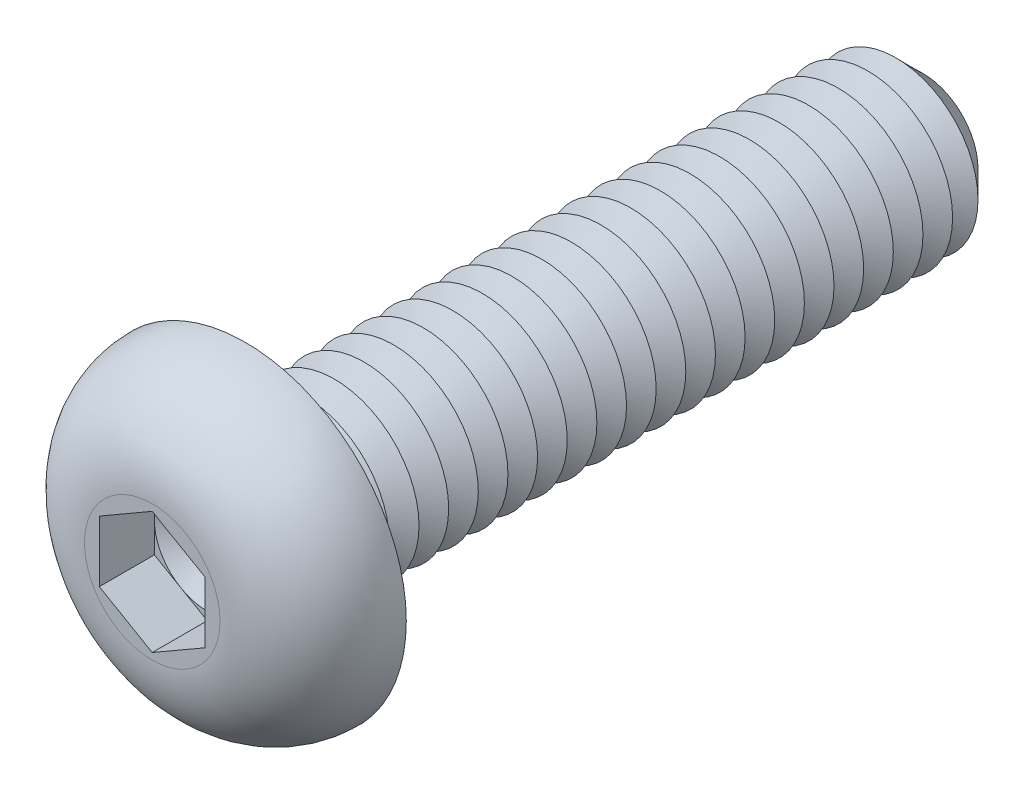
ISO-10303-21;
HEADER;
FILE_DESCRIPTION(('STEP AP214'),'2;1');
FILE_NAME('part.step','',(''),(''),'','','');
FILE_SCHEMA(('AUTOMOTIVE_DESIGN { 1 0 10303 214 1 1 1 1 }'));
ENDSEC;
DATA;
#1=APPLICATION_CONTEXT('core data for automotive mechanical design processes');
#2=APPLICATION_PROTOCOL_DEFINITION('international standard','automotive_design',2000,#1);
#3=PRODUCT_CONTEXT('',#1,'mechanical');
#4=PRODUCT('Part','Part','',(#3));
#5=PRODUCT_RELATED_PRODUCT_CATEGORY('part','',(#4));
#6=PRODUCT_DEFINITION_FORMATION('','',#4);
#7=PRODUCT_DEFINITION_CONTEXT('part definition',#1,'design');
#8=PRODUCT_DEFINITION('design','',#6,#7);
#9=PRODUCT_DEFINITION_SHAPE('','',#8);
#10=(LENGTH_UNIT() NAMED_UNIT(*) SI_UNIT(.MILLI.,.METRE.));
#11=(NAMED_UNIT(*) PLANE_ANGLE_UNIT() SI_UNIT($,.RADIAN.));
#12=(NAMED_UNIT(*) SI_UNIT($,.STERADIAN.) SOLID_ANGLE_UNIT());
#13=UNCERTAINTY_MEASURE_WITH_UNIT(LENGTH_MEASURE(1.E-05),#10,'distance_accuracy_value','');
#14=(GEOMETRIC_REPRESENTATION_CONTEXT(3) GLOBAL_UNCERTAINTY_ASSIGNED_CONTEXT((#13)) GLOBAL_UNIT_ASSIGNED_CONTEXT((#10,
#11,#12)) REPRESENTATION_CONTEXT('',''));
#15=CARTESIAN_POINT('',(0.,0.,0.));
#16=DIRECTION('',(0.,0.,1.));
#17=DIRECTION('',(1.,0.,0.));
#18=AXIS2_PLACEMENT_3D('',#15,#16,#17);
#19=CARTESIAN_POINT('',(0.,0.,0.900000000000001));
#20=DIRECTION('',(0.,0.,1.));
#21=DIRECTION('',(1.,0.,0.));
#22=AXIS2_PLACEMENT_3D('',#19,#20,#21);
#23=PLANE('',#22);
#24=CARTESIAN_POINT('',(0.,0.,0.900000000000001));
#25=DIRECTION('',(0.,0.,1.));
#26=DIRECTION('',(1.,0.,0.));
#27=AXIS2_PLACEMENT_3D('',#24,#25,#26);
#28=CIRCLE('',#27,1.25);
#29=CARTESIAN_POINT('',(1.25,0.,0.900000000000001));
#30=VERTEX_POINT('',#29);
#31=CARTESIAN_POINT('',(0.625,1.08253175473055,0.900000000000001));
#32=VERTEX_POINT('',#31);
#33=EDGE_CURVE('E117',#30,#32,#28,.T.);
#34=ORIENTED_EDGE('',*,*,#33,.F.);
#35=DIRECTION('',(0.,1.,0.));
#36=VECTOR('',#35,1.);
#37=CARTESIAN_POINT('',(1.25,-0.721687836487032,0.900000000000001));
#38=LINE('',#37,#36);
#39=CARTESIAN_POINT('',(1.25,0.721687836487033,0.900000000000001));
#40=VERTEX_POINT('',#39);
#41=EDGE_CURVE('E140',#30,#40,#38,.T.);
#42=ORIENTED_EDGE('',*,*,#41,.T.);
#43=DIRECTION('',(-0.866025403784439,0.5,0.));
#44=VECTOR('',#43,1.);
#45=CARTESIAN_POINT('',(1.25,0.721687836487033,0.900000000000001));
#46=LINE('',#45,#44);
#47=EDGE_CURVE('E135',#40,#32,#46,.T.);
#48=ORIENTED_EDGE('',*,*,#47,.T.);
#49=EDGE_LOOP('',(#34,#42,#48));
#50=FACE_BOUND('',#49,.T.);
#51=ADVANCED_FACE('F39',(#50),#23,.T.);
#52=CARTESIAN_POINT('',(0.,0.,0.900000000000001));
#53=DIRECTION('',(0.,0.,1.));
#54=DIRECTION('',(1.,0.,0.));
#55=AXIS2_PLACEMENT_3D('',#52,#53,#54);
#56=CIRCLE('',#55,1.25);
#57=CARTESIAN_POINT('',(-0.625,1.08253175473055,0.900000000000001));
#58=VERTEX_POINT('',#57);
#59=EDGE_CURVE('E11',#32,#58,#56,.T.);
#60=ORIENTED_EDGE('',*,*,#59,.F.);
#61=CARTESIAN_POINT('',(0.,1.44337567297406,0.900000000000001));
#62=VERTEX_POINT('',#61);
#63=EDGE_CURVE('E130',#32,#62,#46,.T.);
#64=ORIENTED_EDGE('',*,*,#63,.T.);
#65=DIRECTION('',(-0.866025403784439,-0.5,0.));
#66=VECTOR('',#65,1.);
#67=CARTESIAN_POINT('',(0.,1.44337567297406,0.900000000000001));
#68=LINE('',#67,#66);
#69=EDGE_CURVE('E132',#62,#58,#68,.T.);
#70=ORIENTED_EDGE('',*,*,#69,.T.);
#71=EDGE_LOOP('',(#60,#64,#70));
#72=FACE_BOUND('',#71,.T.);
#73=ADVANCED_FACE('F129',(#72),#23,.T.);
#74=CARTESIAN_POINT('',(-1.25,0.,0.900000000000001));
#75=VERTEX_POINT('',#74);
#76=EDGE_CURVE('E49',#58,#75,#56,.T.);
#77=ORIENTED_EDGE('',*,*,#76,.F.);
#78=CARTESIAN_POINT('',(-1.25,0.721687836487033,0.900000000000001));
#79=VERTEX_POINT('',#78);
#80=EDGE_CURVE('E143',#58,#79,#68,.T.);
#81=ORIENTED_EDGE('',*,*,#80,.T.);
#82=DIRECTION('',(0.,-1.,0.));
#83=VECTOR('',#82,1.);
#84=CARTESIAN_POINT('',(-1.25,0.721687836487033,0.900000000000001));
#85=LINE('',#84,#83);
#86=EDGE_CURVE('E153',#79,#75,#85,.T.);
#87=ORIENTED_EDGE('',*,*,#86,.T.);
#88=EDGE_LOOP('',(#77,#81,#87));
#89=FACE_BOUND('',#88,.T.);
#90=ADVANCED_FACE('F255',(#89),#23,.T.);
#91=CARTESIAN_POINT('',(-0.625,-1.08253175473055,0.900000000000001));
#92=VERTEX_POINT('',#91);
#93=EDGE_CURVE('E239',#75,#92,#56,.T.);
#94=ORIENTED_EDGE('',*,*,#93,.F.);
#95=CARTESIAN_POINT('',(-1.25,-0.721687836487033,0.900000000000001));
#96=VERTEX_POINT('',#95);
#97=EDGE_CURVE('E152',#75,#96,#85,.T.);
#98=ORIENTED_EDGE('',*,*,#97,.T.);
#99=DIRECTION('',(0.866025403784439,-0.5,0.));
#100=VECTOR('',#99,1.);
#101=CARTESIAN_POINT('',(-1.25,-0.721687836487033,0.900000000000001));
#102=LINE('',#101,#100);
#103=EDGE_CURVE('E158',#96,#92,#102,.T.);
#104=ORIENTED_EDGE('',*,*,#103,.T.);
#105=EDGE_LOOP('',(#94,#98,#104));
#106=FACE_BOUND('',#105,.T.);
#107=ADVANCED_FACE('F248',(#106),#23,.T.);
#108=CARTESIAN_POINT('',(0.625,-1.08253175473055,0.900000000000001));
#109=VERTEX_POINT('',#108);
#110=EDGE_CURVE('E56',#92,#109,#56,.T.);
#111=ORIENTED_EDGE('',*,*,#110,.F.);
#112=CARTESIAN_POINT('',(0.,-1.44337567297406,0.900000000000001));
#113=VERTEX_POINT('',#112);
#114=EDGE_CURVE('E157',#92,#113,#102,.T.);
#115=ORIENTED_EDGE('',*,*,#114,.T.);
#116=DIRECTION('',(0.866025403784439,0.5,0.));
#117=VECTOR('',#116,1.);
#118=CARTESIAN_POINT('',(0.,-1.44337567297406,0.900000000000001));
#119=LINE('',#118,#117);
#120=EDGE_CURVE('E163',#113,#109,#119,.T.);
#121=ORIENTED_EDGE('',*,*,#120,.T.);
#122=EDGE_LOOP('',(#111,#115,#121));
#123=FACE_BOUND('',#122,.T.);
#124=ADVANCED_FACE('F455',(#123),#23,.T.);
#125=CARTESIAN_POINT('',(0.,0.,-16.));
#126=DIRECTION('',(0.,0.,1.));
#127=DIRECTION('',(1.,0.,0.));
#128=AXIS2_PLACEMENT_3D('',#125,#126,#127);
#129=CYLINDRICAL_SURFACE('',#128,2.);
#130=CARTESIAN_POINT('',(0.,0.,-0.300000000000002));
#131=DIRECTION('',(0.,0.,1.));
#132=DIRECTION('',(1.,0.,0.));
#133=AXIS2_PLACEMENT_3D('',#130,#131,#132);
#134=CIRCLE('',#133,2.);
#135=CARTESIAN_POINT('',(2.,0.,-0.300000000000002));
#136=VERTEX_POINT('',#135);
#137=EDGE_CURVE('E221',#136,#136,#134,.F.);
#138=ORIENTED_EDGE('',*,*,#137,.T.);
#139=EDGE_LOOP('',(#138));
#140=FACE_BOUND('',#139,.T.);
#141=CARTESIAN_POINT('',(0.,0.,-0.699999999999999));
#142=DIRECTION('',(0.,0.,1.));
#143=DIRECTION('',(1.,0.,0.));
#144=AXIS2_PLACEMENT_3D('',#141,#142,#143);
#145=CIRCLE('',#144,2.);
#146=CARTESIAN_POINT('',(2.,0.,-0.699999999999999));
#147=VERTEX_POINT('',#146);
#148=EDGE_CURVE('E148',#147,#147,#145,.T.);
#149=ORIENTED_EDGE('',*,*,#148,.T.);
#150=EDGE_LOOP('',(#149));
#151=FACE_BOUND('',#150,.T.);
#152=ADVANCED_FACE('F439',(#140,#151),#129,.T.);
#153=CARTESIAN_POINT('',(0.,3.8,0.));
#154=DIRECTION('',(0.,0.,1.));
#155=DIRECTION('',(1.,0.,0.));
#156=AXIS2_PLACEMENT_3D('',#153,#154,#155);
#157=PLANE('',#156);
#158=CARTESIAN_POINT('',(0.,0.,0.));
#159=DIRECTION('',(0.,0.,1.));
#160=DIRECTION('',(1.,0.,0.));
#161=AXIS2_PLACEMENT_3D('',#158,#159,#160);
#162=CIRCLE('',#161,2.3);
#163=CARTESIAN_POINT('',(2.3,0.,0.));
#164=VERTEX_POINT('',#163);
#165=EDGE_CURVE('E230',#164,#164,#162,.T.);
#166=ORIENTED_EDGE('',*,*,#165,.T.);
#167=EDGE_LOOP('',(#166));
#168=FACE_BOUND('',#167,.T.);
#169=CARTESIAN_POINT('',(0.,0.,0.));
#170=DIRECTION('',(0.,0.,1.));
#171=DIRECTION('',(1.,0.,0.));
#172=AXIS2_PLACEMENT_3D('',#169,#170,#171);
#173=CIRCLE('',#172,3.8);
#174=CARTESIAN_POINT('',(3.8,0.,0.));
#175=VERTEX_POINT('',#174);
#176=EDGE_CURVE('E195',#175,#175,#173,.T.);
#177=ORIENTED_EDGE('',*,*,#176,.F.);
#178=EDGE_LOOP('',(#177));
#179=FACE_BOUND('',#178,.T.);
#180=ADVANCED_FACE('F485',(#168,#179),#157,.F.);
#181=CARTESIAN_POINT('',(0.,0.,2.2));
#182=DIRECTION('',(0.,0.,-1.));
#183=DIRECTION('',(-1.,0.,0.));
#184=AXIS2_PLACEMENT_3D('',#181,#182,#183);
#185=PLANE('',#184);
#186=DIRECTION('',(-0.866025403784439,-0.5,0.));
#187=VECTOR('',#186,1.);
#188=CARTESIAN_POINT('',(0.,1.44337567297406,2.2));
#189=LINE('',#188,#187);
#190=CARTESIAN_POINT('',(0.,1.44337567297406,2.2));
#191=VERTEX_POINT('',#190);
#192=CARTESIAN_POINT('',(-1.25,0.721687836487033,2.2));
#193=VERTEX_POINT('',#192);
#194=EDGE_CURVE('E173',#191,#193,#189,.T.);
#195=ORIENTED_EDGE('',*,*,#194,.F.);
#196=DIRECTION('',(-0.866025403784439,0.5,0.));
#197=VECTOR('',#196,1.);
#198=CARTESIAN_POINT('',(1.25,0.721687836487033,2.2));
#199=LINE('',#198,#197);
#200=CARTESIAN_POINT('',(1.25,0.721687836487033,2.2));
#201=VERTEX_POINT('',#200);
#202=EDGE_CURVE('E64',#201,#191,#199,.T.);
#203=ORIENTED_EDGE('',*,*,#202,.F.);
#204=DIRECTION('',(0.,1.,0.));
#205=VECTOR('',#204,1.);
#206=CARTESIAN_POINT('',(1.25,-0.721687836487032,2.2));
#207=LINE('',#206,#205);
#208=CARTESIAN_POINT('',(1.25,-0.721687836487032,2.2));
#209=VERTEX_POINT('',#208);
#210=EDGE_CURVE('E138',#209,#201,#207,.T.);
#211=ORIENTED_EDGE('',*,*,#210,.F.);
#212=DIRECTION('',(0.866025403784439,0.5,0.));
#213=VECTOR('',#212,1.);
#214=CARTESIAN_POINT('',(0.,-1.44337567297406,2.2));
#215=LINE('',#214,#213);
#216=CARTESIAN_POINT('',(0.,-1.44337567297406,2.2));
#217=VERTEX_POINT('',#216);
#218=EDGE_CURVE('E185',#217,#209,#215,.T.);
#219=ORIENTED_EDGE('',*,*,#218,.F.);
#220=DIRECTION('',(0.866025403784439,-0.5,0.));
#221=VECTOR('',#220,1.);
#222=CARTESIAN_POINT('',(-1.25,-0.721687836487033,2.2));
#223=LINE('',#222,#221);
#224=CARTESIAN_POINT('',(-1.25,-0.721687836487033,2.2));
#225=VERTEX_POINT('',#224);
#226=EDGE_CURVE('E181',#225,#217,#223,.T.);
#227=ORIENTED_EDGE('',*,*,#226,.F.);
#228=DIRECTION('',(0.,-1.,0.));
#229=VECTOR('',#228,1.);
#230=CARTESIAN_POINT('',(-1.25,0.721687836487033,2.2));
#231=LINE('',#230,#229);
#232=EDGE_CURVE('E177',#193,#225,#231,.T.);
#233=ORIENTED_EDGE('',*,*,#232,.F.);
#234=EDGE_LOOP('',(#195,#203,#211,#219,#227,#233));
#235=FACE_BOUND('',#234,.T.);
#236=CARTESIAN_POINT('',(0.,0.,2.2));
#237=DIRECTION('',(0.,0.,1.));
#238=DIRECTION('',(1.,0.,0.));
#239=AXIS2_PLACEMENT_3D('',#236,#237,#238);
#240=CIRCLE('',#239,1.6);
#241=CARTESIAN_POINT('',(1.6,0.,2.2));
#242=VERTEX_POINT('',#241);
#243=EDGE_CURVE('E213',#242,#242,#240,.T.);
#244=ORIENTED_EDGE('',*,*,#243,.T.);
#245=EDGE_LOOP('',(#244));
#246=FACE_BOUND('',#245,.T.);
#247=ADVANCED_FACE('F264',(#235,#246),#185,.F.);
#248=CARTESIAN_POINT('',(0.,0.,0.));
#249=DIRECTION('',(0.,0.,1.));
#250=DIRECTION('',(1.,0.,0.));
#251=AXIS2_PLACEMENT_3D('',#248,#249,#250);
#252=DEGENERATE_TOROIDAL_SURFACE('',#251,1.6,2.2,.T.);
#253=ORIENTED_EDGE('',*,*,#243,.F.);
#254=EDGE_LOOP('',(#253));
#255=FACE_BOUND('',#254,.T.);
#256=ORIENTED_EDGE('',*,*,#176,.T.);
#257=EDGE_LOOP('',(#256));
#258=FACE_BOUND('',#257,.T.);
#259=ADVANCED_FACE('F479',(#255,#258),#252,.T.);
#260=CARTESIAN_POINT('',(1.25,0.721687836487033,0.900000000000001));
#261=DIRECTION('',(0.5,0.866025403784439,0.));
#262=DIRECTION('',(-0.866025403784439,0.5,0.));
#263=AXIS2_PLACEMENT_3D('',#260,#261,#262);
#264=PLANE('',#263);
#265=ORIENTED_EDGE('',*,*,#202,.T.);
#266=DIRECTION('',(0.,0.,1.));
#267=VECTOR('',#266,1.);
#268=CARTESIAN_POINT('',(0.,1.44337567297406,0.900000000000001));
#269=LINE('',#268,#267);
#270=EDGE_CURVE('E136',#62,#191,#269,.T.);
#271=ORIENTED_EDGE('',*,*,#270,.F.);
#272=ORIENTED_EDGE('',*,*,#63,.F.);
#273=ORIENTED_EDGE('',*,*,#47,.F.);
#274=DIRECTION('',(0.,0.,1.));
#275=VECTOR('',#274,1.);
#276=CARTESIAN_POINT('',(1.25,0.721687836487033,0.900000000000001));
#277=LINE('',#276,#275);
#278=EDGE_CURVE('E192',#40,#201,#277,.T.);
#279=ORIENTED_EDGE('',*,*,#278,.T.);
#280=EDGE_LOOP('',(#265,#271,#272,#273,#279));
#281=FACE_BOUND('',#280,.T.);
#282=ADVANCED_FACE('F134',(#281),#264,.F.);
#283=CARTESIAN_POINT('',(1.25,-0.721687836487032,0.900000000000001));
#284=DIRECTION('',(1.,0.,0.));
#285=DIRECTION('',(0.,1.,0.));
#286=AXIS2_PLACEMENT_3D('',#283,#284,#285);
#287=PLANE('',#286);
#288=ORIENTED_EDGE('',*,*,#210,.T.);
#289=ORIENTED_EDGE('',*,*,#278,.F.);
#290=ORIENTED_EDGE('',*,*,#41,.F.);
#291=CARTESIAN_POINT('',(1.25,-0.721687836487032,0.900000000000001));
#292=VERTEX_POINT('',#291);
#293=EDGE_CURVE('E167',#292,#30,#38,.T.);
#294=ORIENTED_EDGE('',*,*,#293,.F.);
#295=DIRECTION('',(0.,0.,1.));
#296=VECTOR('',#295,1.);
#297=CARTESIAN_POINT('',(1.25,-0.721687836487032,0.900000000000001));
#298=LINE('',#297,#296);
#299=EDGE_CURVE('E196',#292,#209,#298,.T.);
#300=ORIENTED_EDGE('',*,*,#299,.T.);
#301=EDGE_LOOP('',(#288,#289,#290,#294,#300));
#302=FACE_BOUND('',#301,.T.);
#303=ADVANCED_FACE('F463',(#302),#287,.F.);
#304=CARTESIAN_POINT('',(0.,-1.44337567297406,0.900000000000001));
#305=DIRECTION('',(0.5,-0.866025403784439,0.));
#306=DIRECTION('',(0.866025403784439,0.5,0.));
#307=AXIS2_PLACEMENT_3D('',#304,#305,#306);
#308=PLANE('',#307);
#309=ORIENTED_EDGE('',*,*,#218,.T.);
#310=ORIENTED_EDGE('',*,*,#299,.F.);
#311=EDGE_CURVE('E162',#109,#292,#119,.T.);
#312=ORIENTED_EDGE('',*,*,#311,.F.);
#313=ORIENTED_EDGE('',*,*,#120,.F.);
#314=DIRECTION('',(0.,0.,1.));
#315=VECTOR('',#314,1.);
#316=CARTESIAN_POINT('',(0.,-1.44337567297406,0.900000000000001));
#317=LINE('',#316,#315);
#318=EDGE_CURVE('E199',#113,#217,#317,.T.);
#319=ORIENTED_EDGE('',*,*,#318,.T.);
#320=EDGE_LOOP('',(#309,#310,#312,#313,#319));
#321=FACE_BOUND('',#320,.T.);
#322=ADVANCED_FACE('F466',(#321),#308,.F.);
#323=CARTESIAN_POINT('',(-1.25,-0.721687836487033,0.900000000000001));
#324=DIRECTION('',(-0.5,-0.866025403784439,0.));
#325=DIRECTION('',(0.866025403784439,-0.5,0.));
#326=AXIS2_PLACEMENT_3D('',#323,#324,#325);
#327=PLANE('',#326);
#328=ORIENTED_EDGE('',*,*,#226,.T.);
#329=ORIENTED_EDGE('',*,*,#318,.F.);
#330=ORIENTED_EDGE('',*,*,#114,.F.);
#331=ORIENTED_EDGE('',*,*,#103,.F.);
#332=DIRECTION('',(0.,0.,1.));
#333=VECTOR('',#332,1.);
#334=CARTESIAN_POINT('',(-1.25,-0.721687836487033,0.900000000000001));
#335=LINE('',#334,#333);
#336=EDGE_CURVE('E202',#96,#225,#335,.T.);
#337=ORIENTED_EDGE('',*,*,#336,.T.);
#338=EDGE_LOOP('',(#328,#329,#330,#331,#337));
#339=FACE_BOUND('',#338,.T.);
#340=ADVANCED_FACE('F269',(#339),#327,.F.);
#341=CARTESIAN_POINT('',(-1.25,0.721687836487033,0.900000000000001));
#342=DIRECTION('',(-1.,0.,0.));
#343=DIRECTION('',(0.,0.,1.));
#344=AXIS2_PLACEMENT_3D('',#341,#342,#343);
#345=PLANE('',#344);
#346=ORIENTED_EDGE('',*,*,#232,.T.);
#347=ORIENTED_EDGE('',*,*,#336,.F.);
#348=ORIENTED_EDGE('',*,*,#97,.F.);
#349=ORIENTED_EDGE('',*,*,#86,.F.);
#350=DIRECTION('',(0.,0.,1.));
#351=VECTOR('',#350,1.);
#352=CARTESIAN_POINT('',(-1.25,0.721687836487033,0.900000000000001));
#353=LINE('',#352,#351);
#354=EDGE_CURVE('E205',#79,#193,#353,.T.);
#355=ORIENTED_EDGE('',*,*,#354,.T.);
#356=EDGE_LOOP('',(#346,#347,#348,#349,#355));
#357=FACE_BOUND('',#356,.T.);
#358=ADVANCED_FACE('F253',(#357),#345,.F.);
#359=CARTESIAN_POINT('',(0.,1.44337567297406,0.900000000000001));
#360=DIRECTION('',(-0.5,0.866025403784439,0.));
#361=DIRECTION('',(-0.866025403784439,-0.5,0.));
#362=AXIS2_PLACEMENT_3D('',#359,#360,#361);
#363=PLANE('',#362);
#364=ORIENTED_EDGE('',*,*,#194,.T.);
#365=ORIENTED_EDGE('',*,*,#354,.F.);
#366=ORIENTED_EDGE('',*,*,#80,.F.);
#367=ORIENTED_EDGE('',*,*,#69,.F.);
#368=ORIENTED_EDGE('',*,*,#270,.T.);
#369=EDGE_LOOP('',(#364,#365,#366,#367,#368));
#370=FACE_BOUND('',#369,.T.);
#371=ADVANCED_FACE('F258',(#370),#363,.F.);
#372=EDGE_CURVE('E43',#109,#30,#56,.T.);
#373=ORIENTED_EDGE('',*,*,#372,.F.);
#374=ORIENTED_EDGE('',*,*,#311,.T.);
#375=ORIENTED_EDGE('',*,*,#293,.T.);
#376=EDGE_LOOP('',(#373,#374,#375));
#377=FACE_BOUND('',#376,.T.);
#378=ADVANCED_FACE('F444',(#377),#23,.T.);
#379=CARTESIAN_POINT('',(0.,0.,-0.699999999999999));
#380=DIRECTION('',(0.,0.,1.));
#381=DIRECTION('',(1.,0.,0.));
#382=AXIS2_PLACEMENT_3D('',#379,#380,#381);
#383=CONICAL_SURFACE('',#382,2.,1.04719755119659);
#384=CARTESIAN_POINT('',(0.,0.,-1.05));
#385=DIRECTION('',(0.,0.,1.));
#386=DIRECTION('',(1.,0.,0.));
#387=AXIS2_PLACEMENT_3D('',#384,#385,#386);
#388=CIRCLE('',#387,1.3937822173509);
#389=CARTESIAN_POINT('',(1.3937822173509,0.,-1.05));
#390=VERTEX_POINT('',#389);
#391=EDGE_CURVE('E431',#390,#390,#388,.T.);
#392=ORIENTED_EDGE('',*,*,#391,.T.);
#393=EDGE_LOOP('',(#392));
#394=FACE_BOUND('',#393,.T.);
#395=ORIENTED_EDGE('',*,*,#148,.F.);
#396=EDGE_LOOP('',(#395));
#397=FACE_BOUND('',#396,.T.);
#398=ADVANCED_FACE('F441',(#394,#397),#383,.T.);
#399=CARTESIAN_POINT('',(0.,0.,-1.05));
#400=DIRECTION('',(0.,0.,-1.));
#401=DIRECTION('',(-1.,0.,0.));
#402=AXIS2_PLACEMENT_3D('',#399,#400,#401);
#403=CONICAL_SURFACE('',#402,1.3937822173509,1.0471975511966);
#404=CARTESIAN_POINT('',(0.,0.,-1.4));
#405=DIRECTION('',(0.,0.,1.));
#406=DIRECTION('',(1.,0.,0.));
#407=AXIS2_PLACEMENT_3D('',#404,#405,#406);
#408=CIRCLE('',#407,2.);
#409=CARTESIAN_POINT('',(2.,0.,-1.4));
#410=VERTEX_POINT('',#409);
#411=EDGE_CURVE('E428',#410,#410,#408,.T.);
#412=ORIENTED_EDGE('',*,*,#411,.T.);
#413=EDGE_LOOP('',(#412));
#414=FACE_BOUND('',#413,.T.);
#415=ORIENTED_EDGE('',*,*,#391,.F.);
#416=EDGE_LOOP('',(#415));
#417=FACE_BOUND('',#416,.T.);
#418=ADVANCED_FACE('F443',(#414,#417),#403,.T.);
#419=CARTESIAN_POINT('',(0.,0.,-1.4));
#420=DIRECTION('',(0.,0.,1.));
#421=DIRECTION('',(1.,0.,0.));
#422=AXIS2_PLACEMENT_3D('',#419,#420,#421);
#423=CONICAL_SURFACE('',#422,2.,1.04719755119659);
#424=CARTESIAN_POINT('',(0.,0.,-1.75));
#425=DIRECTION('',(0.,0.,1.));
#426=DIRECTION('',(1.,0.,0.));
#427=AXIS2_PLACEMENT_3D('',#424,#425,#426);
#428=CIRCLE('',#427,1.3937822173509);
#429=CARTESIAN_POINT('',(1.3937822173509,0.,-1.75));
#430=VERTEX_POINT('',#429);
#431=EDGE_CURVE('E424',#430,#430,#428,.T.);
#432=ORIENTED_EDGE('',*,*,#431,.T.);
#433=EDGE_LOOP('',(#432));
#434=FACE_BOUND('',#433,.T.);
#435=ORIENTED_EDGE('',*,*,#411,.F.);
#436=EDGE_LOOP('',(#435));
#437=FACE_BOUND('',#436,.T.);
#438=ADVANCED_FACE('F450',(#434,#437),#423,.T.);
#439=CARTESIAN_POINT('',(0.,0.,-1.75));
#440=DIRECTION('',(0.,0.,-1.));
#441=DIRECTION('',(-1.,0.,0.));
#442=AXIS2_PLACEMENT_3D('',#439,#440,#441);
#443=CONICAL_SURFACE('',#442,1.3937822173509,1.0471975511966);
#444=CARTESIAN_POINT('',(0.,0.,-2.1));
#445=DIRECTION('',(0.,0.,1.));
#446=DIRECTION('',(1.,0.,0.));
#447=AXIS2_PLACEMENT_3D('',#444,#445,#446);
#448=CIRCLE('',#447,2.);
#449=CARTESIAN_POINT('',(2.,0.,-2.1));
#450=VERTEX_POINT('',#449);
#451=EDGE_CURVE('E420',#450,#450,#448,.T.);
#452=ORIENTED_EDGE('',*,*,#451,.T.);
#453=EDGE_LOOP('',(#452));
#454=FACE_BOUND('',#453,.T.);
#455=ORIENTED_EDGE('',*,*,#431,.F.);
#456=EDGE_LOOP('',(#455));
#457=FACE_BOUND('',#456,.T.);
#458=ADVANCED_FACE('F656',(#454,#457),#443,.T.);
#459=CARTESIAN_POINT('',(0.,0.,-2.1));
#460=DIRECTION('',(0.,0.,1.));
#461=DIRECTION('',(1.,0.,0.));
#462=AXIS2_PLACEMENT_3D('',#459,#460,#461);
#463=CONICAL_SURFACE('',#462,2.,1.04719755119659);
#464=CARTESIAN_POINT('',(0.,0.,-2.45));
#465=DIRECTION('',(0.,0.,1.));
#466=DIRECTION('',(1.,0.,0.));
#467=AXIS2_PLACEMENT_3D('',#464,#465,#466);
#468=CIRCLE('',#467,1.3937822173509);
#469=CARTESIAN_POINT('',(1.3937822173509,0.,-2.45));
#470=VERTEX_POINT('',#469);
#471=EDGE_CURVE('E416',#470,#470,#468,.T.);
#472=ORIENTED_EDGE('',*,*,#471,.T.);
#473=EDGE_LOOP('',(#472));
#474=FACE_BOUND('',#473,.T.);
#475=ORIENTED_EDGE('',*,*,#451,.F.);
#476=EDGE_LOOP('',(#475));
#477=FACE_BOUND('',#476,.T.);
#478=ADVANCED_FACE('F652',(#474,#477),#463,.T.);
#479=CARTESIAN_POINT('',(0.,0.,-2.45));
#480=DIRECTION('',(0.,0.,-1.));
#481=DIRECTION('',(-1.,0.,0.));
#482=AXIS2_PLACEMENT_3D('',#479,#480,#481);
#483=CONICAL_SURFACE('',#482,1.3937822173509,1.0471975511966);
#484=CARTESIAN_POINT('',(0.,0.,-2.8));
#485=DIRECTION('',(0.,0.,1.));
#486=DIRECTION('',(1.,0.,0.));
#487=AXIS2_PLACEMENT_3D('',#484,#485,#486);
#488=CIRCLE('',#487,2.);
#489=CARTESIAN_POINT('',(2.,0.,-2.8));
#490=VERTEX_POINT('',#489);
#491=EDGE_CURVE('E412',#490,#490,#488,.T.);
#492=ORIENTED_EDGE('',*,*,#491,.T.);
#493=EDGE_LOOP('',(#492));
#494=FACE_BOUND('',#493,.T.);
#495=ORIENTED_EDGE('',*,*,#471,.F.);
#496=EDGE_LOOP('',(#495));
#497=FACE_BOUND('',#496,.T.);
#498=ADVANCED_FACE('F648',(#494,#497),#483,.T.);
#499=CARTESIAN_POINT('',(0.,0.,-2.8));
#500=DIRECTION('',(0.,0.,1.));
#501=DIRECTION('',(1.,0.,0.));
#502=AXIS2_PLACEMENT_3D('',#499,#500,#501);
#503=CONICAL_SURFACE('',#502,2.,1.04719755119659);
#504=CARTESIAN_POINT('',(0.,0.,-3.15));
#505=DIRECTION('',(0.,0.,1.));
#506=DIRECTION('',(1.,0.,0.));
#507=AXIS2_PLACEMENT_3D('',#504,#505,#506);
#508=CIRCLE('',#507,1.3937822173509);
#509=CARTESIAN_POINT('',(1.3937822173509,0.,-3.15));
#510=VERTEX_POINT('',#509);
#511=EDGE_CURVE('E408',#510,#510,#508,.T.);
#512=ORIENTED_EDGE('',*,*,#511,.T.);
#513=EDGE_LOOP('',(#512));
#514=FACE_BOUND('',#513,.T.);
#515=ORIENTED_EDGE('',*,*,#491,.F.);
#516=EDGE_LOOP('',(#515));
#517=FACE_BOUND('',#516,.T.);
#518=ADVANCED_FACE('F644',(#514,#517),#503,.T.);
#519=CARTESIAN_POINT('',(0.,0.,-3.15));
#520=DIRECTION('',(0.,0.,-1.));
#521=DIRECTION('',(-1.,0.,0.));
#522=AXIS2_PLACEMENT_3D('',#519,#520,#521);
#523=CONICAL_SURFACE('',#522,1.3937822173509,1.0471975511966);
#524=CARTESIAN_POINT('',(0.,0.,-3.5));
#525=DIRECTION('',(0.,0.,1.));
#526=DIRECTION('',(1.,0.,0.));
#527=AXIS2_PLACEMENT_3D('',#524,#525,#526);
#528=CIRCLE('',#527,2.);
#529=CARTESIAN_POINT('',(2.,0.,-3.5));
#530=VERTEX_POINT('',#529);
#531=EDGE_CURVE('E404',#530,#530,#528,.T.);
#532=ORIENTED_EDGE('',*,*,#531,.T.);
#533=EDGE_LOOP('',(#532));
#534=FACE_BOUND('',#533,.T.);
#535=ORIENTED_EDGE('',*,*,#511,.F.);
#536=EDGE_LOOP('',(#535));
#537=FACE_BOUND('',#536,.T.);
#538=ADVANCED_FACE('F640',(#534,#537),#523,.T.);
#539=CARTESIAN_POINT('',(0.,0.,-3.5));
#540=DIRECTION('',(0.,0.,1.));
#541=DIRECTION('',(1.,0.,0.));
#542=AXIS2_PLACEMENT_3D('',#539,#540,#541);
#543=CONICAL_SURFACE('',#542,2.,1.04719755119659);
#544=CARTESIAN_POINT('',(0.,0.,-3.85));
#545=DIRECTION('',(0.,0.,1.));
#546=DIRECTION('',(1.,0.,0.));
#547=AXIS2_PLACEMENT_3D('',#544,#545,#546);
#548=CIRCLE('',#547,1.3937822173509);
#549=CARTESIAN_POINT('',(1.3937822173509,0.,-3.85));
#550=VERTEX_POINT('',#549);
#551=EDGE_CURVE('E400',#550,#550,#548,.T.);
#552=ORIENTED_EDGE('',*,*,#551,.T.);
#553=EDGE_LOOP('',(#552));
#554=FACE_BOUND('',#553,.T.);
#555=ORIENTED_EDGE('',*,*,#531,.F.);
#556=EDGE_LOOP('',(#555));
#557=FACE_BOUND('',#556,.T.);
#558=ADVANCED_FACE('F636',(#554,#557),#543,.T.);
#559=CARTESIAN_POINT('',(0.,0.,-3.85));
#560=DIRECTION('',(0.,0.,-1.));
#561=DIRECTION('',(-1.,0.,0.));
#562=AXIS2_PLACEMENT_3D('',#559,#560,#561);
#563=CONICAL_SURFACE('',#562,1.3937822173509,1.0471975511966);
#564=CARTESIAN_POINT('',(0.,0.,-4.2));
#565=DIRECTION('',(0.,0.,1.));
#566=DIRECTION('',(1.,0.,0.));
#567=AXIS2_PLACEMENT_3D('',#564,#565,#566);
#568=CIRCLE('',#567,2.);
#569=CARTESIAN_POINT('',(2.,0.,-4.2));
#570=VERTEX_POINT('',#569);
#571=EDGE_CURVE('E396',#570,#570,#568,.T.);
#572=ORIENTED_EDGE('',*,*,#571,.T.);
#573=EDGE_LOOP('',(#572));
#574=FACE_BOUND('',#573,.T.);
#575=ORIENTED_EDGE('',*,*,#551,.F.);
#576=EDGE_LOOP('',(#575));
#577=FACE_BOUND('',#576,.T.);
#578=ADVANCED_FACE('F632',(#574,#577),#563,.T.);
#579=CARTESIAN_POINT('',(0.,0.,-4.2));
#580=DIRECTION('',(0.,0.,1.));
#581=DIRECTION('',(1.,0.,0.));
#582=AXIS2_PLACEMENT_3D('',#579,#580,#581);
#583=CONICAL_SURFACE('',#582,2.,1.04719755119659);
#584=CARTESIAN_POINT('',(0.,0.,-4.55));
#585=DIRECTION('',(0.,0.,1.));
#586=DIRECTION('',(1.,0.,0.));
#587=AXIS2_PLACEMENT_3D('',#584,#585,#586);
#588=CIRCLE('',#587,1.3937822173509);
#589=CARTESIAN_POINT('',(1.3937822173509,0.,-4.55));
#590=VERTEX_POINT('',#589);
#591=EDGE_CURVE('E392',#590,#590,#588,.T.);
#592=ORIENTED_EDGE('',*,*,#591,.T.);
#593=EDGE_LOOP('',(#592));
#594=FACE_BOUND('',#593,.T.);
#595=ORIENTED_EDGE('',*,*,#571,.F.);
#596=EDGE_LOOP('',(#595));
#597=FACE_BOUND('',#596,.T.);
#598=ADVANCED_FACE('F628',(#594,#597),#583,.T.);
#599=CARTESIAN_POINT('',(0.,0.,-4.55));
#600=DIRECTION('',(0.,0.,-1.));
#601=DIRECTION('',(-1.,0.,0.));
#602=AXIS2_PLACEMENT_3D('',#599,#600,#601);
#603=CONICAL_SURFACE('',#602,1.3937822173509,1.0471975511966);
#604=CARTESIAN_POINT('',(0.,0.,-4.9));
#605=DIRECTION('',(0.,0.,1.));
#606=DIRECTION('',(1.,0.,0.));
#607=AXIS2_PLACEMENT_3D('',#604,#605,#606);
#608=CIRCLE('',#607,2.);
#609=CARTESIAN_POINT('',(2.,0.,-4.9));
#610=VERTEX_POINT('',#609);
#611=EDGE_CURVE('E388',#610,#610,#608,.T.);
#612=ORIENTED_EDGE('',*,*,#611,.T.);
#613=EDGE_LOOP('',(#612));
#614=FACE_BOUND('',#613,.T.);
#615=ORIENTED_EDGE('',*,*,#591,.F.);
#616=EDGE_LOOP('',(#615));
#617=FACE_BOUND('',#616,.T.);
#618=ADVANCED_FACE('F624',(#614,#617),#603,.T.);
#619=CARTESIAN_POINT('',(0.,0.,-4.9));
#620=DIRECTION('',(0.,0.,1.));
#621=DIRECTION('',(1.,0.,0.));
#622=AXIS2_PLACEMENT_3D('',#619,#620,#621);
#623=CONICAL_SURFACE('',#622,2.,1.04719755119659);
#624=CARTESIAN_POINT('',(0.,0.,-5.25));
#625=DIRECTION('',(0.,0.,1.));
#626=DIRECTION('',(1.,0.,0.));
#627=AXIS2_PLACEMENT_3D('',#624,#625,#626);
#628=CIRCLE('',#627,1.3937822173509);
#629=CARTESIAN_POINT('',(1.3937822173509,0.,-5.25));
#630=VERTEX_POINT('',#629);
#631=EDGE_CURVE('E384',#630,#630,#628,.T.);
#632=ORIENTED_EDGE('',*,*,#631,.T.);
#633=EDGE_LOOP('',(#632));
#634=FACE_BOUND('',#633,.T.);
#635=ORIENTED_EDGE('',*,*,#611,.F.);
#636=EDGE_LOOP('',(#635));
#637=FACE_BOUND('',#636,.T.);
#638=ADVANCED_FACE('F620',(#634,#637),#623,.T.);
#639=CARTESIAN_POINT('',(0.,0.,-5.25));
#640=DIRECTION('',(0.,0.,-1.));
#641=DIRECTION('',(-1.,0.,0.));
#642=AXIS2_PLACEMENT_3D('',#639,#640,#641);
#643=CONICAL_SURFACE('',#642,1.3937822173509,1.0471975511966);
#644=CARTESIAN_POINT('',(0.,0.,-5.6));
#645=DIRECTION('',(0.,0.,1.));
#646=DIRECTION('',(1.,0.,0.));
#647=AXIS2_PLACEMENT_3D('',#644,#645,#646);
#648=CIRCLE('',#647,2.);
#649=CARTESIAN_POINT('',(2.,0.,-5.6));
#650=VERTEX_POINT('',#649);
#651=EDGE_CURVE('E380',#650,#650,#648,.T.);
#652=ORIENTED_EDGE('',*,*,#651,.T.);
#653=EDGE_LOOP('',(#652));
#654=FACE_BOUND('',#653,.T.);
#655=ORIENTED_EDGE('',*,*,#631,.F.);
#656=EDGE_LOOP('',(#655));
#657=FACE_BOUND('',#656,.T.);
#658=ADVANCED_FACE('F616',(#654,#657),#643,.T.);
#659=CARTESIAN_POINT('',(0.,0.,-5.6));
#660=DIRECTION('',(0.,0.,1.));
#661=DIRECTION('',(1.,0.,0.));
#662=AXIS2_PLACEMENT_3D('',#659,#660,#661);
#663=CONICAL_SURFACE('',#662,2.,1.04719755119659);
#664=CARTESIAN_POINT('',(0.,0.,-5.95));
#665=DIRECTION('',(0.,0.,1.));
#666=DIRECTION('',(1.,0.,0.));
#667=AXIS2_PLACEMENT_3D('',#664,#665,#666);
#668=CIRCLE('',#667,1.3937822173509);
#669=CARTESIAN_POINT('',(1.3937822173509,0.,-5.95));
#670=VERTEX_POINT('',#669);
#671=EDGE_CURVE('E376',#670,#670,#668,.T.);
#672=ORIENTED_EDGE('',*,*,#671,.T.);
#673=EDGE_LOOP('',(#672));
#674=FACE_BOUND('',#673,.T.);
#675=ORIENTED_EDGE('',*,*,#651,.F.);
#676=EDGE_LOOP('',(#675));
#677=FACE_BOUND('',#676,.T.);
#678=ADVANCED_FACE('F612',(#674,#677),#663,.T.);
#679=CARTESIAN_POINT('',(0.,0.,-5.95));
#680=DIRECTION('',(0.,0.,-1.));
#681=DIRECTION('',(-1.,0.,0.));
#682=AXIS2_PLACEMENT_3D('',#679,#680,#681);
#683=CONICAL_SURFACE('',#682,1.3937822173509,1.0471975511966);
#684=CARTESIAN_POINT('',(0.,0.,-6.3));
#685=DIRECTION('',(0.,0.,1.));
#686=DIRECTION('',(1.,0.,0.));
#687=AXIS2_PLACEMENT_3D('',#684,#685,#686);
#688=CIRCLE('',#687,2.);
#689=CARTESIAN_POINT('',(2.,0.,-6.3));
#690=VERTEX_POINT('',#689);
#691=EDGE_CURVE('E372',#690,#690,#688,.T.);
#692=ORIENTED_EDGE('',*,*,#691,.T.);
#693=EDGE_LOOP('',(#692));
#694=FACE_BOUND('',#693,.T.);
#695=ORIENTED_EDGE('',*,*,#671,.F.);
#696=EDGE_LOOP('',(#695));
#697=FACE_BOUND('',#696,.T.);
#698=ADVANCED_FACE('F608',(#694,#697),#683,.T.);
#699=CARTESIAN_POINT('',(0.,0.,-6.3));
#700=DIRECTION('',(0.,0.,1.));
#701=DIRECTION('',(1.,0.,0.));
#702=AXIS2_PLACEMENT_3D('',#699,#700,#701);
#703=CONICAL_SURFACE('',#702,2.,1.04719755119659);
#704=CARTESIAN_POINT('',(0.,0.,-6.65));
#705=DIRECTION('',(0.,0.,1.));
#706=DIRECTION('',(1.,0.,0.));
#707=AXIS2_PLACEMENT_3D('',#704,#705,#706);
#708=CIRCLE('',#707,1.3937822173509);
#709=CARTESIAN_POINT('',(1.3937822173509,0.,-6.65));
#710=VERTEX_POINT('',#709);
#711=EDGE_CURVE('E368',#710,#710,#708,.T.);
#712=ORIENTED_EDGE('',*,*,#711,.T.);
#713=EDGE_LOOP('',(#712));
#714=FACE_BOUND('',#713,.T.);
#715=ORIENTED_EDGE('',*,*,#691,.F.);
#716=EDGE_LOOP('',(#715));
#717=FACE_BOUND('',#716,.T.);
#718=ADVANCED_FACE('F604',(#714,#717),#703,.T.);
#719=CARTESIAN_POINT('',(0.,0.,-6.65));
#720=DIRECTION('',(0.,0.,-1.));
#721=DIRECTION('',(-1.,0.,0.));
#722=AXIS2_PLACEMENT_3D('',#719,#720,#721);
#723=CONICAL_SURFACE('',#722,1.3937822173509,1.0471975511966);
#724=CARTESIAN_POINT('',(0.,0.,-7.));
#725=DIRECTION('',(0.,0.,1.));
#726=DIRECTION('',(1.,0.,0.));
#727=AXIS2_PLACEMENT_3D('',#724,#725,#726);
#728=CIRCLE('',#727,2.);
#729=CARTESIAN_POINT('',(2.,0.,-7.));
#730=VERTEX_POINT('',#729);
#731=EDGE_CURVE('E365',#730,#730,#728,.T.);
#732=ORIENTED_EDGE('',*,*,#731,.T.);
#733=EDGE_LOOP('',(#732));
#734=FACE_BOUND('',#733,.T.);
#735=ORIENTED_EDGE('',*,*,#711,.F.);
#736=EDGE_LOOP('',(#735));
#737=FACE_BOUND('',#736,.T.);
#738=ADVANCED_FACE('F600',(#734,#737),#723,.T.);
#739=CARTESIAN_POINT('',(0.,0.,-7.));
#740=DIRECTION('',(0.,0.,1.));
#741=DIRECTION('',(1.,0.,0.));
#742=AXIS2_PLACEMENT_3D('',#739,#740,#741);
#743=CONICAL_SURFACE('',#742,2.,1.04719755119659);
#744=CARTESIAN_POINT('',(0.,0.,-7.35));
#745=DIRECTION('',(0.,0.,1.));
#746=DIRECTION('',(1.,0.,0.));
#747=AXIS2_PLACEMENT_3D('',#744,#745,#746);
#748=CIRCLE('',#747,1.3937822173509);
#749=CARTESIAN_POINT('',(1.3937822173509,0.,-7.35));
#750=VERTEX_POINT('',#749);
#751=EDGE_CURVE('E362',#750,#750,#748,.T.);
#752=ORIENTED_EDGE('',*,*,#751,.T.);
#753=EDGE_LOOP('',(#752));
#754=FACE_BOUND('',#753,.T.);
#755=ORIENTED_EDGE('',*,*,#731,.F.);
#756=EDGE_LOOP('',(#755));
#757=FACE_BOUND('',#756,.T.);
#758=ADVANCED_FACE('F596',(#754,#757),#743,.T.);
#759=CARTESIAN_POINT('',(0.,0.,-7.35));
#760=DIRECTION('',(0.,0.,-1.));
#761=DIRECTION('',(-1.,0.,0.));
#762=AXIS2_PLACEMENT_3D('',#759,#760,#761);
#763=CONICAL_SURFACE('',#762,1.3937822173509,1.0471975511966);
#764=CARTESIAN_POINT('',(0.,0.,-7.7));
#765=DIRECTION('',(0.,0.,1.));
#766=DIRECTION('',(1.,0.,0.));
#767=AXIS2_PLACEMENT_3D('',#764,#765,#766);
#768=CIRCLE('',#767,2.);
#769=CARTESIAN_POINT('',(2.,0.,-7.7));
#770=VERTEX_POINT('',#769);
#771=EDGE_CURVE('E358',#770,#770,#768,.T.);
#772=ORIENTED_EDGE('',*,*,#771,.T.);
#773=EDGE_LOOP('',(#772));
#774=FACE_BOUND('',#773,.T.);
#775=ORIENTED_EDGE('',*,*,#751,.F.);
#776=EDGE_LOOP('',(#775));
#777=FACE_BOUND('',#776,.T.);
#778=ADVANCED_FACE('F592',(#774,#777),#763,.T.);
#779=CARTESIAN_POINT('',(0.,0.,-7.7));
#780=DIRECTION('',(0.,0.,1.));
#781=DIRECTION('',(1.,0.,0.));
#782=AXIS2_PLACEMENT_3D('',#779,#780,#781);
#783=CONICAL_SURFACE('',#782,2.,1.04719755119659);
#784=CARTESIAN_POINT('',(0.,0.,-8.05));
#785=DIRECTION('',(0.,0.,1.));
#786=DIRECTION('',(1.,0.,0.));
#787=AXIS2_PLACEMENT_3D('',#784,#785,#786);
#788=CIRCLE('',#787,1.3937822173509);
#789=CARTESIAN_POINT('',(1.3937822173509,0.,-8.05));
#790=VERTEX_POINT('',#789);
#791=EDGE_CURVE('E354',#790,#790,#788,.T.);
#792=ORIENTED_EDGE('',*,*,#791,.T.);
#793=EDGE_LOOP('',(#792));
#794=FACE_BOUND('',#793,.T.);
#795=ORIENTED_EDGE('',*,*,#771,.F.);
#796=EDGE_LOOP('',(#795));
#797=FACE_BOUND('',#796,.T.);
#798=ADVANCED_FACE('F588',(#794,#797),#783,.T.);
#799=CARTESIAN_POINT('',(0.,0.,-8.05));
#800=DIRECTION('',(0.,0.,-1.));
#801=DIRECTION('',(-1.,0.,0.));
#802=AXIS2_PLACEMENT_3D('',#799,#800,#801);
#803=CONICAL_SURFACE('',#802,1.3937822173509,1.0471975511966);
#804=CARTESIAN_POINT('',(0.,0.,-8.4));
#805=DIRECTION('',(0.,0.,1.));
#806=DIRECTION('',(1.,0.,0.));
#807=AXIS2_PLACEMENT_3D('',#804,#805,#806);
#808=CIRCLE('',#807,2.);
#809=CARTESIAN_POINT('',(2.,0.,-8.4));
#810=VERTEX_POINT('',#809);
#811=EDGE_CURVE('E350',#810,#810,#808,.T.);
#812=ORIENTED_EDGE('',*,*,#811,.T.);
#813=EDGE_LOOP('',(#812));
#814=FACE_BOUND('',#813,.T.);
#815=ORIENTED_EDGE('',*,*,#791,.F.);
#816=EDGE_LOOP('',(#815));
#817=FACE_BOUND('',#816,.T.);
#818=ADVANCED_FACE('F584',(#814,#817),#803,.T.);
#819=CARTESIAN_POINT('',(0.,0.,-8.4));
#820=DIRECTION('',(0.,0.,1.));
#821=DIRECTION('',(1.,0.,0.));
#822=AXIS2_PLACEMENT_3D('',#819,#820,#821);
#823=CONICAL_SURFACE('',#822,2.,1.04719755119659);
#824=CARTESIAN_POINT('',(0.,0.,-8.75));
#825=DIRECTION('',(0.,0.,1.));
#826=DIRECTION('',(1.,0.,0.));
#827=AXIS2_PLACEMENT_3D('',#824,#825,#826);
#828=CIRCLE('',#827,1.3937822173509);
#829=CARTESIAN_POINT('',(1.3937822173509,0.,-8.75));
#830=VERTEX_POINT('',#829);
#831=EDGE_CURVE('E346',#830,#830,#828,.T.);
#832=ORIENTED_EDGE('',*,*,#831,.T.);
#833=EDGE_LOOP('',(#832));
#834=FACE_BOUND('',#833,.T.);
#835=ORIENTED_EDGE('',*,*,#811,.F.);
#836=EDGE_LOOP('',(#835));
#837=FACE_BOUND('',#836,.T.);
#838=ADVANCED_FACE('F580',(#834,#837),#823,.T.);
#839=CARTESIAN_POINT('',(0.,0.,-8.75));
#840=DIRECTION('',(0.,0.,-1.));
#841=DIRECTION('',(-1.,0.,0.));
#842=AXIS2_PLACEMENT_3D('',#839,#840,#841);
#843=CONICAL_SURFACE('',#842,1.3937822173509,1.0471975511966);
#844=CARTESIAN_POINT('',(0.,0.,-9.1));
#845=DIRECTION('',(0.,0.,1.));
#846=DIRECTION('',(1.,0.,0.));
#847=AXIS2_PLACEMENT_3D('',#844,#845,#846);
#848=CIRCLE('',#847,2.);
#849=CARTESIAN_POINT('',(2.,0.,-9.1));
#850=VERTEX_POINT('',#849);
#851=EDGE_CURVE('E342',#850,#850,#848,.T.);
#852=ORIENTED_EDGE('',*,*,#851,.T.);
#853=EDGE_LOOP('',(#852));
#854=FACE_BOUND('',#853,.T.);
#855=ORIENTED_EDGE('',*,*,#831,.F.);
#856=EDGE_LOOP('',(#855));
#857=FACE_BOUND('',#856,.T.);
#858=ADVANCED_FACE('F576',(#854,#857),#843,.T.);
#859=CARTESIAN_POINT('',(0.,0.,-9.1));
#860=DIRECTION('',(0.,0.,1.));
#861=DIRECTION('',(1.,0.,0.));
#862=AXIS2_PLACEMENT_3D('',#859,#860,#861);
#863=CONICAL_SURFACE('',#862,2.,1.04719755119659);
#864=CARTESIAN_POINT('',(0.,0.,-9.45));
#865=DIRECTION('',(0.,0.,1.));
#866=DIRECTION('',(1.,0.,0.));
#867=AXIS2_PLACEMENT_3D('',#864,#865,#866);
#868=CIRCLE('',#867,1.3937822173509);
#869=CARTESIAN_POINT('',(1.3937822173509,0.,-9.45));
#870=VERTEX_POINT('',#869);
#871=EDGE_CURVE('E338',#870,#870,#868,.T.);
#872=ORIENTED_EDGE('',*,*,#871,.T.);
#873=EDGE_LOOP('',(#872));
#874=FACE_BOUND('',#873,.T.);
#875=ORIENTED_EDGE('',*,*,#851,.F.);
#876=EDGE_LOOP('',(#875));
#877=FACE_BOUND('',#876,.T.);
#878=ADVANCED_FACE('F572',(#874,#877),#863,.T.);
#879=CARTESIAN_POINT('',(0.,0.,-9.45));
#880=DIRECTION('',(0.,0.,-1.));
#881=DIRECTION('',(-1.,0.,0.));
#882=AXIS2_PLACEMENT_3D('',#879,#880,#881);
#883=CONICAL_SURFACE('',#882,1.3937822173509,1.0471975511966);
#884=CARTESIAN_POINT('',(0.,0.,-9.8));
#885=DIRECTION('',(0.,0.,1.));
#886=DIRECTION('',(1.,0.,0.));
#887=AXIS2_PLACEMENT_3D('',#884,#885,#886);
#888=CIRCLE('',#887,2.);
#889=CARTESIAN_POINT('',(2.,0.,-9.8));
#890=VERTEX_POINT('',#889);
#891=EDGE_CURVE('E334',#890,#890,#888,.T.);
#892=ORIENTED_EDGE('',*,*,#891,.T.);
#893=EDGE_LOOP('',(#892));
#894=FACE_BOUND('',#893,.T.);
#895=ORIENTED_EDGE('',*,*,#871,.F.);
#896=EDGE_LOOP('',(#895));
#897=FACE_BOUND('',#896,.T.);
#898=ADVANCED_FACE('F568',(#894,#897),#883,.T.);
#899=CARTESIAN_POINT('',(0.,0.,-9.8));
#900=DIRECTION('',(0.,0.,1.));
#901=DIRECTION('',(1.,0.,0.));
#902=AXIS2_PLACEMENT_3D('',#899,#900,#901);
#903=CONICAL_SURFACE('',#902,2.,1.04719755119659);
#904=CARTESIAN_POINT('',(0.,0.,-10.15));
#905=DIRECTION('',(0.,0.,1.));
#906=DIRECTION('',(1.,0.,0.));
#907=AXIS2_PLACEMENT_3D('',#904,#905,#906);
#908=CIRCLE('',#907,1.3937822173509);
#909=CARTESIAN_POINT('',(1.3937822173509,0.,-10.15));
#910=VERTEX_POINT('',#909);
#911=EDGE_CURVE('E330',#910,#910,#908,.T.);
#912=ORIENTED_EDGE('',*,*,#911,.T.);
#913=EDGE_LOOP('',(#912));
#914=FACE_BOUND('',#913,.T.);
#915=ORIENTED_EDGE('',*,*,#891,.F.);
#916=EDGE_LOOP('',(#915));
#917=FACE_BOUND('',#916,.T.);
#918=ADVANCED_FACE('F564',(#914,#917),#903,.T.);
#919=CARTESIAN_POINT('',(0.,0.,-10.15));
#920=DIRECTION('',(0.,0.,-1.));
#921=DIRECTION('',(-1.,0.,0.));
#922=AXIS2_PLACEMENT_3D('',#919,#920,#921);
#923=CONICAL_SURFACE('',#922,1.3937822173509,1.0471975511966);
#924=CARTESIAN_POINT('',(0.,0.,-10.5));
#925=DIRECTION('',(0.,0.,1.));
#926=DIRECTION('',(1.,0.,0.));
#927=AXIS2_PLACEMENT_3D('',#924,#925,#926);
#928=CIRCLE('',#927,2.);
#929=CARTESIAN_POINT('',(2.,0.,-10.5));
#930=VERTEX_POINT('',#929);
#931=EDGE_CURVE('E326',#930,#930,#928,.T.);
#932=ORIENTED_EDGE('',*,*,#931,.T.);
#933=EDGE_LOOP('',(#932));
#934=FACE_BOUND('',#933,.T.);
#935=ORIENTED_EDGE('',*,*,#911,.F.);
#936=EDGE_LOOP('',(#935));
#937=FACE_BOUND('',#936,.T.);
#938=ADVANCED_FACE('F560',(#934,#937),#923,.T.);
#939=CARTESIAN_POINT('',(0.,0.,-10.5));
#940=DIRECTION('',(0.,0.,1.));
#941=DIRECTION('',(1.,0.,0.));
#942=AXIS2_PLACEMENT_3D('',#939,#940,#941);
#943=CONICAL_SURFACE('',#942,2.,1.04719755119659);
#944=CARTESIAN_POINT('',(0.,0.,-10.85));
#945=DIRECTION('',(0.,0.,1.));
#946=DIRECTION('',(1.,0.,0.));
#947=AXIS2_PLACEMENT_3D('',#944,#945,#946);
#948=CIRCLE('',#947,1.3937822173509);
#949=CARTESIAN_POINT('',(1.3937822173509,0.,-10.85));
#950=VERTEX_POINT('',#949);
#951=EDGE_CURVE('E322',#950,#950,#948,.T.);
#952=ORIENTED_EDGE('',*,*,#951,.T.);
#953=EDGE_LOOP('',(#952));
#954=FACE_BOUND('',#953,.T.);
#955=ORIENTED_EDGE('',*,*,#931,.F.);
#956=EDGE_LOOP('',(#955));
#957=FACE_BOUND('',#956,.T.);
#958=ADVANCED_FACE('F556',(#954,#957),#943,.T.);
#959=CARTESIAN_POINT('',(0.,0.,-10.85));
#960=DIRECTION('',(0.,0.,-1.));
#961=DIRECTION('',(-1.,0.,0.));
#962=AXIS2_PLACEMENT_3D('',#959,#960,#961);
#963=CONICAL_SURFACE('',#962,1.3937822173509,1.0471975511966);
#964=CARTESIAN_POINT('',(0.,0.,-11.2));
#965=DIRECTION('',(0.,0.,1.));
#966=DIRECTION('',(1.,0.,0.));
#967=AXIS2_PLACEMENT_3D('',#964,#965,#966);
#968=CIRCLE('',#967,2.);
#969=CARTESIAN_POINT('',(2.,0.,-11.2));
#970=VERTEX_POINT('',#969);
#971=EDGE_CURVE('E318',#970,#970,#968,.T.);
#972=ORIENTED_EDGE('',*,*,#971,.T.);
#973=EDGE_LOOP('',(#972));
#974=FACE_BOUND('',#973,.T.);
#975=ORIENTED_EDGE('',*,*,#951,.F.);
#976=EDGE_LOOP('',(#975));
#977=FACE_BOUND('',#976,.T.);
#978=ADVANCED_FACE('F552',(#974,#977),#963,.T.);
#979=CARTESIAN_POINT('',(0.,0.,-11.2));
#980=DIRECTION('',(0.,0.,1.));
#981=DIRECTION('',(1.,0.,0.));
#982=AXIS2_PLACEMENT_3D('',#979,#980,#981);
#983=CONICAL_SURFACE('',#982,2.,1.04719755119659);
#984=CARTESIAN_POINT('',(0.,0.,-11.55));
#985=DIRECTION('',(0.,0.,1.));
#986=DIRECTION('',(1.,0.,0.));
#987=AXIS2_PLACEMENT_3D('',#984,#985,#986);
#988=CIRCLE('',#987,1.3937822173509);
#989=CARTESIAN_POINT('',(1.3937822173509,0.,-11.55));
#990=VERTEX_POINT('',#989);
#991=EDGE_CURVE('E314',#990,#990,#988,.T.);
#992=ORIENTED_EDGE('',*,*,#991,.T.);
#993=EDGE_LOOP('',(#992));
#994=FACE_BOUND('',#993,.T.);
#995=ORIENTED_EDGE('',*,*,#971,.F.);
#996=EDGE_LOOP('',(#995));
#997=FACE_BOUND('',#996,.T.);
#998=ADVANCED_FACE('F548',(#994,#997),#983,.T.);
#999=CARTESIAN_POINT('',(0.,0.,-11.55));
#1000=DIRECTION('',(0.,0.,-1.));
#1001=DIRECTION('',(-1.,0.,0.));
#1002=AXIS2_PLACEMENT_3D('',#999,#1000,#1001);
#1003=CONICAL_SURFACE('',#1002,1.3937822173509,1.0471975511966);
#1004=CARTESIAN_POINT('',(0.,0.,-11.9));
#1005=DIRECTION('',(0.,0.,1.));
#1006=DIRECTION('',(1.,0.,0.));
#1007=AXIS2_PLACEMENT_3D('',#1004,#1005,#1006);
#1008=CIRCLE('',#1007,2.);
#1009=CARTESIAN_POINT('',(2.,0.,-11.9));
#1010=VERTEX_POINT('',#1009);
#1011=EDGE_CURVE('E310',#1010,#1010,#1008,.T.);
#1012=ORIENTED_EDGE('',*,*,#1011,.T.);
#1013=EDGE_LOOP('',(#1012));
#1014=FACE_BOUND('',#1013,.T.);
#1015=ORIENTED_EDGE('',*,*,#991,.F.);
#1016=EDGE_LOOP('',(#1015));
#1017=FACE_BOUND('',#1016,.T.);
#1018=ADVANCED_FACE('F544',(#1014,#1017),#1003,.T.);
#1019=CARTESIAN_POINT('',(0.,0.,-11.9));
#1020=DIRECTION('',(0.,0.,1.));
#1021=DIRECTION('',(1.,0.,0.));
#1022=AXIS2_PLACEMENT_3D('',#1019,#1020,#1021);
#1023=CONICAL_SURFACE('',#1022,2.,1.04719755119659);
#1024=CARTESIAN_POINT('',(0.,0.,-12.25));
#1025=DIRECTION('',(0.,0.,1.));
#1026=DIRECTION('',(1.,0.,0.));
#1027=AXIS2_PLACEMENT_3D('',#1024,#1025,#1026);
#1028=CIRCLE('',#1027,1.3937822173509);
#1029=CARTESIAN_POINT('',(1.3937822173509,0.,-12.25));
#1030=VERTEX_POINT('',#1029);
#1031=EDGE_CURVE('E306',#1030,#1030,#1028,.T.);
#1032=ORIENTED_EDGE('',*,*,#1031,.T.);
#1033=EDGE_LOOP('',(#1032));
#1034=FACE_BOUND('',#1033,.T.);
#1035=ORIENTED_EDGE('',*,*,#1011,.F.);
#1036=EDGE_LOOP('',(#1035));
#1037=FACE_BOUND('',#1036,.T.);
#1038=ADVANCED_FACE('F540',(#1034,#1037),#1023,.T.);
#1039=CARTESIAN_POINT('',(0.,0.,-12.25));
#1040=DIRECTION('',(0.,0.,-1.));
#1041=DIRECTION('',(-1.,0.,0.));
#1042=AXIS2_PLACEMENT_3D('',#1039,#1040,#1041);
#1043=CONICAL_SURFACE('',#1042,1.3937822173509,1.0471975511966);
#1044=CARTESIAN_POINT('',(0.,0.,-12.6));
#1045=DIRECTION('',(0.,0.,1.));
#1046=DIRECTION('',(1.,0.,0.));
#1047=AXIS2_PLACEMENT_3D('',#1044,#1045,#1046);
#1048=CIRCLE('',#1047,2.);
#1049=CARTESIAN_POINT('',(2.,0.,-12.6));
#1050=VERTEX_POINT('',#1049);
#1051=EDGE_CURVE('E302',#1050,#1050,#1048,.T.);
#1052=ORIENTED_EDGE('',*,*,#1051,.T.);
#1053=EDGE_LOOP('',(#1052));
#1054=FACE_BOUND('',#1053,.T.);
#1055=ORIENTED_EDGE('',*,*,#1031,.F.);
#1056=EDGE_LOOP('',(#1055));
#1057=FACE_BOUND('',#1056,.T.);
#1058=ADVANCED_FACE('F536',(#1054,#1057),#1043,.T.);
#1059=CARTESIAN_POINT('',(0.,0.,-12.6));
#1060=DIRECTION('',(0.,0.,1.));
#1061=DIRECTION('',(1.,0.,0.));
#1062=AXIS2_PLACEMENT_3D('',#1059,#1060,#1061);
#1063=CONICAL_SURFACE('',#1062,2.,1.04719755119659);
#1064=CARTESIAN_POINT('',(0.,0.,-12.95));
#1065=DIRECTION('',(0.,0.,1.));
#1066=DIRECTION('',(1.,0.,0.));
#1067=AXIS2_PLACEMENT_3D('',#1064,#1065,#1066);
#1068=CIRCLE('',#1067,1.3937822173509);
#1069=CARTESIAN_POINT('',(1.3937822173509,0.,-12.95));
#1070=VERTEX_POINT('',#1069);
#1071=EDGE_CURVE('E298',#1070,#1070,#1068,.T.);
#1072=ORIENTED_EDGE('',*,*,#1071,.T.);
#1073=EDGE_LOOP('',(#1072));
#1074=FACE_BOUND('',#1073,.T.);
#1075=ORIENTED_EDGE('',*,*,#1051,.F.);
#1076=EDGE_LOOP('',(#1075));
#1077=FACE_BOUND('',#1076,.T.);
#1078=ADVANCED_FACE('F532',(#1074,#1077),#1063,.T.);
#1079=CARTESIAN_POINT('',(0.,0.,-12.95));
#1080=DIRECTION('',(0.,0.,-1.));
#1081=DIRECTION('',(-1.,0.,0.));
#1082=AXIS2_PLACEMENT_3D('',#1079,#1080,#1081);
#1083=CONICAL_SURFACE('',#1082,1.3937822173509,1.0471975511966);
#1084=CARTESIAN_POINT('',(0.,0.,-13.3));
#1085=DIRECTION('',(0.,0.,1.));
#1086=DIRECTION('',(1.,0.,0.));
#1087=AXIS2_PLACEMENT_3D('',#1084,#1085,#1086);
#1088=CIRCLE('',#1087,2.);
#1089=CARTESIAN_POINT('',(2.,0.,-13.3));
#1090=VERTEX_POINT('',#1089);
#1091=EDGE_CURVE('E294',#1090,#1090,#1088,.T.);
#1092=ORIENTED_EDGE('',*,*,#1091,.T.);
#1093=EDGE_LOOP('',(#1092));
#1094=FACE_BOUND('',#1093,.T.);
#1095=ORIENTED_EDGE('',*,*,#1071,.F.);
#1096=EDGE_LOOP('',(#1095));
#1097=FACE_BOUND('',#1096,.T.);
#1098=ADVANCED_FACE('F528',(#1094,#1097),#1083,.T.);
#1099=CARTESIAN_POINT('',(0.,0.,-13.3));
#1100=DIRECTION('',(0.,0.,1.));
#1101=DIRECTION('',(1.,0.,0.));
#1102=AXIS2_PLACEMENT_3D('',#1099,#1100,#1101);
#1103=CONICAL_SURFACE('',#1102,2.,1.04719755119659);
#1104=CARTESIAN_POINT('',(0.,0.,-13.65));
#1105=DIRECTION('',(0.,0.,1.));
#1106=DIRECTION('',(1.,0.,0.));
#1107=AXIS2_PLACEMENT_3D('',#1104,#1105,#1106);
#1108=CIRCLE('',#1107,1.3937822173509);
#1109=CARTESIAN_POINT('',(1.3937822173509,0.,-13.65));
#1110=VERTEX_POINT('',#1109);
#1111=EDGE_CURVE('E290',#1110,#1110,#1108,.T.);
#1112=ORIENTED_EDGE('',*,*,#1111,.T.);
#1113=EDGE_LOOP('',(#1112));
#1114=FACE_BOUND('',#1113,.T.);
#1115=ORIENTED_EDGE('',*,*,#1091,.F.);
#1116=EDGE_LOOP('',(#1115));
#1117=FACE_BOUND('',#1116,.T.);
#1118=ADVANCED_FACE('F524',(#1114,#1117),#1103,.T.);
#1119=CARTESIAN_POINT('',(0.,0.,-13.65));
#1120=DIRECTION('',(0.,0.,-1.));
#1121=DIRECTION('',(-1.,0.,0.));
#1122=AXIS2_PLACEMENT_3D('',#1119,#1120,#1121);
#1123=CONICAL_SURFACE('',#1122,1.3937822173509,1.0471975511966);
#1124=CARTESIAN_POINT('',(0.,0.,-14.));
#1125=DIRECTION('',(0.,0.,1.));
#1126=DIRECTION('',(1.,0.,0.));
#1127=AXIS2_PLACEMENT_3D('',#1124,#1125,#1126);
#1128=CIRCLE('',#1127,2.);
#1129=CARTESIAN_POINT('',(2.,0.,-14.));
#1130=VERTEX_POINT('',#1129);
#1131=EDGE_CURVE('E286',#1130,#1130,#1128,.T.);
#1132=ORIENTED_EDGE('',*,*,#1131,.T.);
#1133=EDGE_LOOP('',(#1132));
#1134=FACE_BOUND('',#1133,.T.);
#1135=ORIENTED_EDGE('',*,*,#1111,.F.);
#1136=EDGE_LOOP('',(#1135));
#1137=FACE_BOUND('',#1136,.T.);
#1138=ADVANCED_FACE('F520',(#1134,#1137),#1123,.T.);
#1139=CARTESIAN_POINT('',(0.,0.,-14.));
#1140=DIRECTION('',(0.,0.,1.));
#1141=DIRECTION('',(1.,0.,0.));
#1142=AXIS2_PLACEMENT_3D('',#1139,#1140,#1141);
#1143=CONICAL_SURFACE('',#1142,2.,1.04719755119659);
#1144=CARTESIAN_POINT('',(0.,0.,-14.35));
#1145=DIRECTION('',(0.,0.,1.));
#1146=DIRECTION('',(1.,0.,0.));
#1147=AXIS2_PLACEMENT_3D('',#1144,#1145,#1146);
#1148=CIRCLE('',#1147,1.3937822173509);
#1149=CARTESIAN_POINT('',(1.3937822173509,0.,-14.35));
#1150=VERTEX_POINT('',#1149);
#1151=EDGE_CURVE('E226',#1150,#1150,#1148,.T.);
#1152=ORIENTED_EDGE('',*,*,#1151,.T.);
#1153=EDGE_LOOP('',(#1152));
#1154=FACE_BOUND('',#1153,.T.);
#1155=ORIENTED_EDGE('',*,*,#1131,.F.);
#1156=EDGE_LOOP('',(#1155));
#1157=FACE_BOUND('',#1156,.T.);
#1158=ADVANCED_FACE('F515',(#1154,#1157),#1143,.T.);
#1159=CARTESIAN_POINT('',(0.,0.,-14.35));
#1160=DIRECTION('',(0.,0.,-1.));
#1161=DIRECTION('',(-1.,0.,0.));
#1162=AXIS2_PLACEMENT_3D('',#1159,#1160,#1161);
#1163=CONICAL_SURFACE('',#1162,1.3937822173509,1.0471975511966);
#1164=CARTESIAN_POINT('',(0.,0.,-14.7));
#1165=DIRECTION('',(0.,0.,1.));
#1166=DIRECTION('',(1.,0.,0.));
#1167=AXIS2_PLACEMENT_3D('',#1164,#1165,#1166);
#1168=CIRCLE('',#1167,2.);
#1169=CARTESIAN_POINT('',(2.,0.,-14.7));
#1170=VERTEX_POINT('',#1169);
#1171=EDGE_CURVE('E227',#1170,#1170,#1168,.T.);
#1172=ORIENTED_EDGE('',*,*,#1171,.T.);
#1173=EDGE_LOOP('',(#1172));
#1174=FACE_BOUND('',#1173,.T.);
#1175=ORIENTED_EDGE('',*,*,#1151,.F.);
#1176=EDGE_LOOP('',(#1175));
#1177=FACE_BOUND('',#1176,.T.);
#1178=ADVANCED_FACE('F510',(#1174,#1177),#1163,.T.);
#1179=CARTESIAN_POINT('',(0.,0.,-14.7));
#1180=DIRECTION('',(0.,0.,1.));
#1181=DIRECTION('',(1.,0.,0.));
#1182=AXIS2_PLACEMENT_3D('',#1179,#1180,#1181);
#1183=CONICAL_SURFACE('',#1182,2.,1.04719755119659);
#1184=CARTESIAN_POINT('',(0.,0.,-15.05));
#1185=DIRECTION('',(0.,0.,1.));
#1186=DIRECTION('',(1.,0.,0.));
#1187=AXIS2_PLACEMENT_3D('',#1184,#1185,#1186);
#1188=CIRCLE('',#1187,1.3937822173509);
#1189=CARTESIAN_POINT('',(1.3937822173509,0.,-15.05));
#1190=VERTEX_POINT('',#1189);
#1191=EDGE_CURVE('E124',#1190,#1190,#1188,.T.);
#1192=ORIENTED_EDGE('',*,*,#1191,.T.);
#1193=EDGE_LOOP('',(#1192));
#1194=FACE_BOUND('',#1193,.T.);
#1195=ORIENTED_EDGE('',*,*,#1171,.F.);
#1196=EDGE_LOOP('',(#1195));
#1197=FACE_BOUND('',#1196,.T.);
#1198=ADVANCED_FACE('F504',(#1194,#1197),#1183,.T.);
#1199=CARTESIAN_POINT('',(0.,0.,-15.05));
#1200=DIRECTION('',(0.,0.,-1.));
#1201=DIRECTION('',(-1.,0.,0.));
#1202=AXIS2_PLACEMENT_3D('',#1199,#1200,#1201);
#1203=CONICAL_SURFACE('',#1202,1.3937822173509,1.0471975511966);
#1204=CARTESIAN_POINT('',(0.,0.,-15.3633974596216));
#1205=DIRECTION('',(0.,0.,-1.));
#1206=DIRECTION('',(-1.,0.,0.));
#1207=AXIS2_PLACEMENT_3D('',#1204,#1205,#1206);
#1208=CIRCLE('',#1207,1.93660254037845);
#1209=CARTESIAN_POINT('',(1.93660254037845,0.,-15.3633974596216));
#1210=VERTEX_POINT('',#1209);
#1211=EDGE_CURVE('E222',#1210,#1210,#1208,.T.);
#1212=ORIENTED_EDGE('',*,*,#1211,.F.);
#1213=EDGE_LOOP('',(#1212));
#1214=FACE_BOUND('',#1213,.T.);
#1215=ORIENTED_EDGE('',*,*,#1191,.F.);
#1216=EDGE_LOOP('',(#1215));
#1217=FACE_BOUND('',#1216,.T.);
#1218=ADVANCED_FACE('F496',(#1214,#1217),#1203,.T.);
#1219=CARTESIAN_POINT('',(0.,0.,-16.));
#1220=DIRECTION('',(0.,0.,-1.));
#1221=DIRECTION('',(-1.,0.,0.));
#1222=AXIS2_PLACEMENT_3D('',#1219,#1220,#1221);
#1223=PLANE('',#1222);
#1224=CARTESIAN_POINT('',(0.,0.,-16.));
#1225=DIRECTION('',(0.,0.,-1.));
#1226=DIRECTION('',(-1.,0.,0.));
#1227=AXIS2_PLACEMENT_3D('',#1224,#1225,#1226);
#1228=CIRCLE('',#1227,1.3);
#1229=CARTESIAN_POINT('',(1.3,0.,-16.));
#1230=VERTEX_POINT('',#1229);
#1231=EDGE_CURVE('E217',#1230,#1230,#1228,.T.);
#1232=ORIENTED_EDGE('',*,*,#1231,.T.);
#1233=EDGE_LOOP('',(#1232));
#1234=FACE_BOUND('',#1233,.T.);
#1235=ADVANCED_FACE('F489',(#1234),#1223,.T.);
#1236=CARTESIAN_POINT('',(0.,0.,-16.));
#1237=DIRECTION('',(0.,0.,1.));
#1238=DIRECTION('',(1.,0.,0.));
#1239=AXIS2_PLACEMENT_3D('',#1236,#1237,#1238);
#1240=CONICAL_SURFACE('',#1239,1.3,0.785398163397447);
#1241=CARTESIAN_POINT('',(1.3,0.,-16.));
#1242=CARTESIAN_POINT('',(1.30663127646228,0.,-15.9933687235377));
#1243=CARTESIAN_POINT('',(1.31326255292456,0.,-15.9867374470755));
#1244=CARTESIAN_POINT('',(1.32652510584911,0.,-15.9734748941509));
#1245=CARTESIAN_POINT('',(1.33315638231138,0.,-15.9668436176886));
#1246=CARTESIAN_POINT('',(1.34641893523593,0.,-15.9535810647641));
#1247=CARTESIAN_POINT('',(1.35305021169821,0.,-15.9469497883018));
#1248=CARTESIAN_POINT('',(1.36631276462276,0.,-15.9336872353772));
#1249=CARTESIAN_POINT('',(1.37294404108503,0.,-15.927055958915));
#1250=CARTESIAN_POINT('',(1.38620659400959,0.,-15.9137934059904));
#1251=CARTESIAN_POINT('',(1.39283787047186,0.,-15.9071621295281));
#1252=CARTESIAN_POINT('',(1.40610042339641,0.,-15.8938995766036));
#1253=CARTESIAN_POINT('',(1.41273169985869,0.,-15.8872683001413));
#1254=CARTESIAN_POINT('',(1.42599425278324,0.,-15.8740057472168));
#1255=CARTESIAN_POINT('',(1.43262552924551,0.,-15.8673744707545));
#1256=CARTESIAN_POINT('',(1.44588808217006,0.,-15.8541119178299));
#1257=CARTESIAN_POINT('',(1.45251935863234,0.,-15.8474806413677));
#1258=CARTESIAN_POINT('',(1.46578191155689,0.,-15.8342180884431));
#1259=CARTESIAN_POINT('',(1.47241318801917,0.,-15.8275868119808));
#1260=CARTESIAN_POINT('',(1.48567574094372,0.,-15.8143242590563));
#1261=CARTESIAN_POINT('',(1.49230701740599,0.,-15.807692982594));
#1262=CARTESIAN_POINT('',(1.50556957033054,0.,-15.7944304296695));
#1263=CARTESIAN_POINT('',(1.51220084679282,0.,-15.7877991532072));
#1264=CARTESIAN_POINT('',(1.52546339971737,0.,-15.7745366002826));
#1265=CARTESIAN_POINT('',(1.53209467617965,0.,-15.7679053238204));
#1266=CARTESIAN_POINT('',(1.5453572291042,0.,-15.7546427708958));
#1267=CARTESIAN_POINT('',(1.55198850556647,0.,-15.7480114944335));
#1268=CARTESIAN_POINT('',(1.56525105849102,0.,-15.734748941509));
#1269=CARTESIAN_POINT('',(1.5718823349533,0.,-15.7281176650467));
#1270=CARTESIAN_POINT('',(1.58514488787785,0.,-15.7148551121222));
#1271=CARTESIAN_POINT('',(1.59177616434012,0.,-15.7082238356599));
#1272=CARTESIAN_POINT('',(1.60503871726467,0.,-15.6949612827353));
#1273=CARTESIAN_POINT('',(1.61166999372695,0.,-15.6883300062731));
#1274=CARTESIAN_POINT('',(1.6249325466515,0.,-15.6750674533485));
#1275=CARTESIAN_POINT('',(1.63156382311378,0.,-15.6684361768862));
#1276=CARTESIAN_POINT('',(1.64482637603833,0.,-15.6551736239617));
#1277=CARTESIAN_POINT('',(1.6514576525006,0.,-15.6485423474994));
#1278=CARTESIAN_POINT('',(1.66472020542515,0.,-15.6352797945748));
#1279=CARTESIAN_POINT('',(1.67135148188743,0.,-15.6286485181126));
#1280=CARTESIAN_POINT('',(1.68461403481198,0.,-15.615385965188));
#1281=CARTESIAN_POINT('',(1.69124531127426,0.,-15.6087546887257));
#1282=CARTESIAN_POINT('',(1.70450786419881,0.,-15.5954921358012));
#1283=CARTESIAN_POINT('',(1.71113914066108,0.,-15.5888608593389));
#1284=CARTESIAN_POINT('',(1.72440169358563,0.,-15.5755983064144));
#1285=CARTESIAN_POINT('',(1.73103297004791,0.,-15.5689670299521));
#1286=CARTESIAN_POINT('',(1.74429552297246,0.,-15.5557044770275));
#1287=CARTESIAN_POINT('',(1.75092679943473,0.,-15.5490732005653));
#1288=CARTESIAN_POINT('',(1.76418935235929,0.,-15.5358106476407));
#1289=CARTESIAN_POINT('',(1.77082062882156,0.,-15.5291793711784));
#1290=CARTESIAN_POINT('',(1.78408318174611,0.,-15.5159168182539));
#1291=CARTESIAN_POINT('',(1.79071445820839,0.,-15.5092855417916));
#1292=CARTESIAN_POINT('',(1.80397701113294,0.,-15.4960229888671));
#1293=CARTESIAN_POINT('',(1.81060828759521,0.,-15.4893917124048));
#1294=CARTESIAN_POINT('',(1.82387084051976,0.,-15.4761291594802));
#1295=CARTESIAN_POINT('',(1.83050211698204,0.,-15.469497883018));
#1296=CARTESIAN_POINT('',(1.84376466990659,0.,-15.4562353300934));
#1297=CARTESIAN_POINT('',(1.85039594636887,0.,-15.4496040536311));
#1298=CARTESIAN_POINT('',(1.86365849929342,0.,-15.4363415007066));
#1299=CARTESIAN_POINT('',(1.87028977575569,0.,-15.4297102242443));
#1300=CARTESIAN_POINT('',(1.88355232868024,0.,-15.4164476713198));
#1301=CARTESIAN_POINT('',(1.89018360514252,0.,-15.4098163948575));
#1302=CARTESIAN_POINT('',(1.90344615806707,0.,-15.3965538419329));
#1303=CARTESIAN_POINT('',(1.91007743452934,0.,-15.3899225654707));
#1304=CARTESIAN_POINT('',(1.9233399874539,0.,-15.3766600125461));
#1305=CARTESIAN_POINT('',(1.92997126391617,0.,-15.3700287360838));
#1306=CARTESIAN_POINT('',(1.93660254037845,0.,-15.3633974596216));
#1307=B_SPLINE_CURVE_WITH_KNOTS('',3,(#1241,#1242,#1243,#1244,#1245,#1246,#1247,#1248,#1249,
#1250,#1251,#1252,#1253,#1254,#1255,#1256,#1257,#1258,#1259,#1260,#1261,#1262,#1263,#1264,#1265,
#1266,#1267,#1268,#1269,#1270,#1271,#1272,#1273,#1274,#1275,#1276,#1277,#1278,#1279,#1280,#1281,
#1282,#1283,#1284,#1285,#1286,#1287,#1288,#1289,#1290,#1291,#1292,#1293,#1294,#1295,#1296,#1297,
#1298,#1299,#1300,#1301,#1302,#1303,#1304,#1305,#1306),.UNSPECIFIED.,.F.,.F.,(4,2,2,2,2,2,2,2,2,
2,2,2,2,2,2,2,2,2,2,2,2,2,2,2,2,2,2,2,2,2,2,2,4),(0.,0.0281341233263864,0.0562682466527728,
0.0844023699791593,0.112536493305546,0.140670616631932,0.168804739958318,0.196938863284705,
0.225072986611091,0.253207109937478,0.281341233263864,0.30947535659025,0.337609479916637,
0.365743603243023,0.39387772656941,0.422011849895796,0.450145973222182,0.478280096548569,
0.506414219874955,0.53454834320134,0.562682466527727,0.590816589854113,0.6189507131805,
0.647084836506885,0.675218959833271,0.703353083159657,0.731487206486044,0.75962132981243,
0.787755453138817,0.815889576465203,0.84402369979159,0.872157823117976,0.900291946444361),.UNSPECIFIED.);
#1308=EDGE_CURVE('BSEAM487',#1230,#1210,#1307,.T.);
#1309=ORIENTED_EDGE('',*,*,#1231,.F.);
#1310=ORIENTED_EDGE('',*,*,#1211,.T.);
#1311=ORIENTED_EDGE('',*,*,#1308,.T.);
#1312=ORIENTED_EDGE('',*,*,#1308,.F.);
#1313=EDGE_LOOP('',(#1309,#1311,#1310,#1312));
#1314=FACE_BOUND('',#1313,.T.);
#1315=ADVANCED_FACE('F487',(#1314),#1240,.T.);
#1316=CARTESIAN_POINT('',(0.,0.,-0.300000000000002));
#1317=DIRECTION('',(0.,0.,1.));
#1318=DIRECTION('',(1.,0.,0.));
#1319=AXIS2_PLACEMENT_3D('',#1316,#1317,#1318);
#1320=TOROIDAL_SURFACE('',#1319,2.3,0.3);
#1321=ORIENTED_EDGE('',*,*,#165,.F.);
#1322=EDGE_LOOP('',(#1321));
#1323=FACE_BOUND('',#1322,.T.);
#1324=ORIENTED_EDGE('',*,*,#137,.F.);
#1325=EDGE_LOOP('',(#1324));
#1326=FACE_BOUND('',#1325,.T.);
#1327=ADVANCED_FACE('F41',(#1323,#1326),#1320,.F.);
#1328=CARTESIAN_POINT('',(0.,0.,0.900000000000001));
#1329=DIRECTION('',(0.,0.,1.));
#1330=DIRECTION('',(1.,0.,0.));
#1331=AXIS2_PLACEMENT_3D('',#1328,#1329,#1330);
#1332=CONICAL_SURFACE('',#1331,1.25,1.0471975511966);
#1333=CARTESIAN_POINT('',(0.,0.,0.178312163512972));
#1334=VERTEX_POINT('',#1333);
#1335=VERTEX_LOOP('',#1334);
#1336=FACE_BOUND('',#1335,.T.);
#1337=ORIENTED_EDGE('',*,*,#33,.T.);
#1338=ORIENTED_EDGE('',*,*,#59,.T.);
#1339=ORIENTED_EDGE('',*,*,#76,.T.);
#1340=ORIENTED_EDGE('',*,*,#93,.T.);
#1341=ORIENTED_EDGE('',*,*,#110,.T.);
#1342=ORIENTED_EDGE('',*,*,#372,.T.);
#1343=EDGE_LOOP('',(#1337,#1338,#1339,#1340,#1341,#1342));
#1344=FACE_BOUND('',#1343,.T.);
#1345=ADVANCED_FACE('F113',(#1336,#1344),#1332,.F.);
#1346=CLOSED_SHELL('',(#51,#73,#90,#107,#124,#152,#180,#247,#259,#282,#303,#322,#340,#358,#371,
#378,#398,#418,#438,#458,#478,#498,#518,#538,#558,#578,#598,#618,#638,#658,#678,#698,#718,#738,
#758,#778,#798,#818,#838,#858,#878,#898,#918,#938,#958,#978,#998,#1018,#1038,#1058,#1078,#1098,
#1118,#1138,#1158,#1178,#1198,#1218,#1235,#1315,#1327,#1345));
#1347=MANIFOLD_SOLID_BREP('B2',#1346);
#1348=ADVANCED_BREP_SHAPE_REPRESENTATION('',(#18,#1347),#14);
#1349=SHAPE_DEFINITION_REPRESENTATION(#9,#1348);
ENDSEC;
END-ISO-10303-21;
